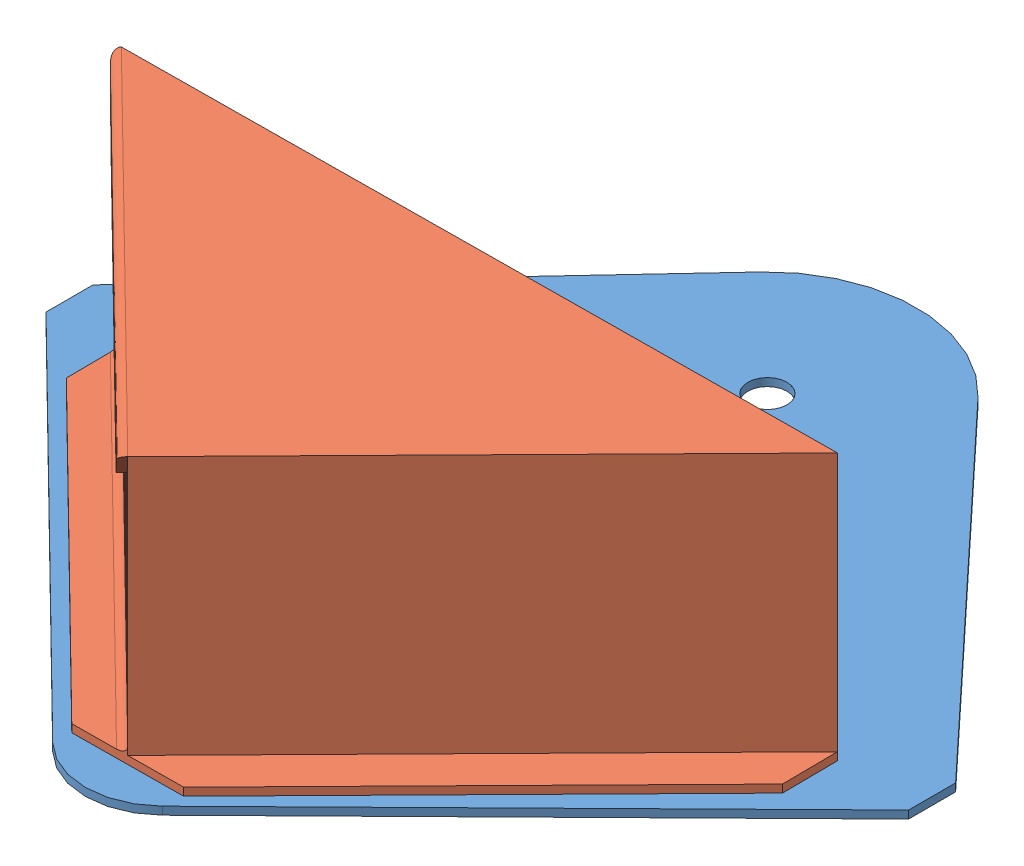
SolidWorks assembly WallMountedContainer3.SLDASM, configuration Default (file format 4100). Lengths in mm.
Overall size (110 35 106).
2 component instances, 2 part files, 4 mates.
Components (placement in the parent):
- WallMountedContainer3Base-1: WallMountedContainer3Base.SLDPRT [Default] at (-0.8859 6.1597 42.443) size (110 1 106)
- WallMountedContainer3BodyBent-2: WallMountedContainer3BodyBent.SLDPRT [Default] at (-0.7043 40.1597 47.2017) x (0.999959 0 -0.009024) z (0 1 0) size (90.8 45.55 34)
Mates (geometry in assembly coordinates):
- Coincident2: coincident anti-aligned: plane of WallMountedContainer3Base-1 through (-0.8859 7.1597 -34.557) normal (0 1 0); plane of WallMountedContainer3BodyBent-2 through (3.5636 7.1597 49.9917) normal (0 -1 0)
- Parallel1: parallel aligned: plane of WallMountedContainer3Base-1 through (-55.8859 7.1597 2.443) normal (-0.700697 0 0.713459); plane of WallMountedContainer3BodyBent-2 through (-46.3657 41.1597 2.3571) normal (-0.700697 0 0.713459)
- Coincident5: coincident: point of WallMountedContainer3Base-1; line of WallMountedContainer3BodyBent-2 through (-46.3657 7.1597 2.3571) axis (0.999959 0 -0.009024)
- Distance2: distance = 2 mm: line of WallMountedContainer3BodyBent-2 through (-7.7751 8.1597 47.2655) axis (-0.713459 0 -0.700697); line of WallMountedContainer3Base-1 through (-55.8859 7.1597 2.443) axis (0.713459 0 0.700697)
